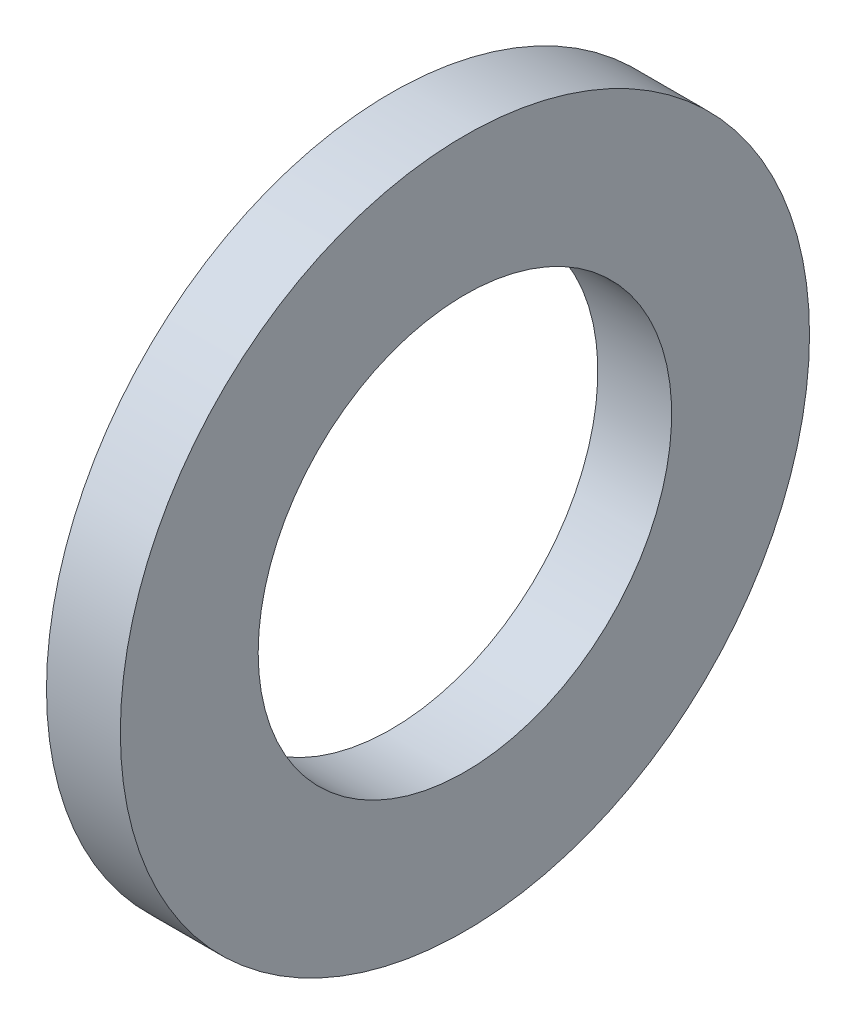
from build123d import *

# Parameters (mm, degrees)
ESQUISSE1_W = 1.5
ESQUISSE1_H = 2.8


with BuildPart() as part:
    # Esquisse1 → Base-R_volution (revolve)
    with BuildSketch(Plane(origin=(0, 0, 0), x_dir=(1, 0, 0), z_dir=(0, 1, 0)), mode=Mode.PRIVATE) as base_r_volution_sk:
        with Locations((0.75, 5.6)):
            Rectangle(ESQUISSE1_W, ESQUISSE1_H)
    revolve(base_r_volution_sk.sketch.rotate(Axis((0, 0, 0), (1, 0, 0)), 180), axis=Axis((0, 0, 0), (1, 0, 0)))


solid = part.part
